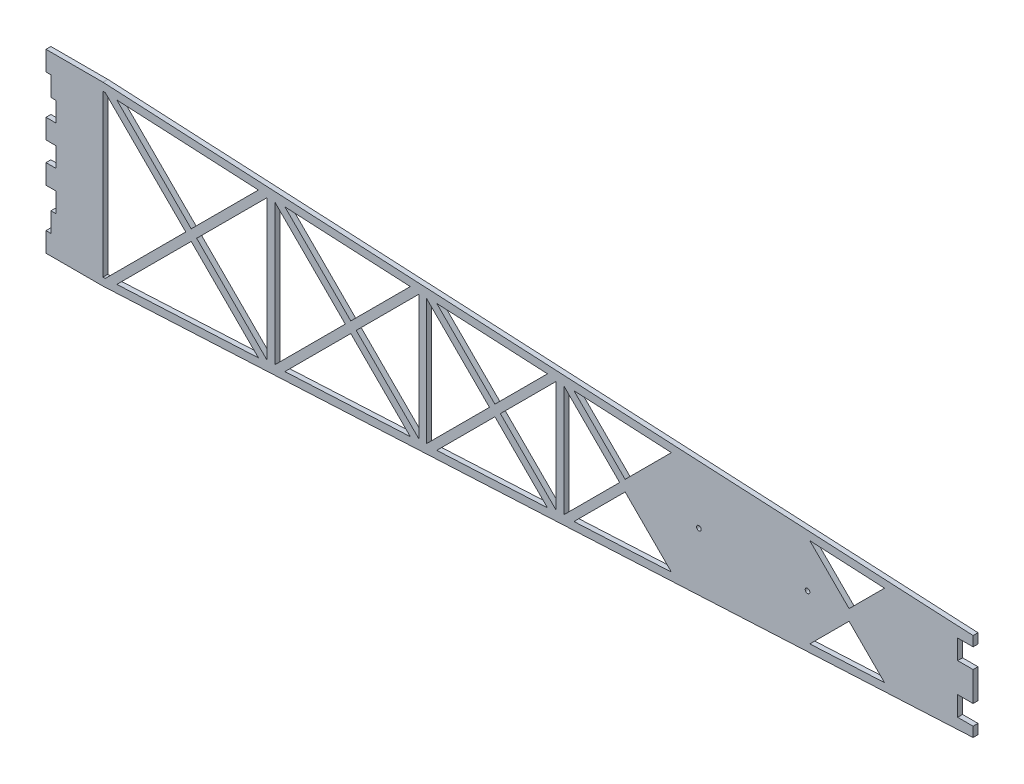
from build123d import *

# Parameters (mm, degrees)
BOSS_EXTRUDE1_DEPTH     = 3.175
CUT_EXTRUDE1_DEPTH      = 611.79830601
CUT_EXTRUDE1_DEPTH_BACK = 611.79830601
CUT_EXTRUDE2_DEPTH      = 611.79830601
CUT_EXTRUDE2_DEPTH_BACK = 611.79830601
SKETCH5_W               = 10
SKETCH5_H               = 12.7
CUT_EXTRUDE3_DEPTH      = 611.79830601
CUT_EXTRUDE3_DEPTH_BACK = 611.79830601
SKETCH6_R               = 1.5
CUT_EXTRUDE4_DEPTH      = 611.79830601
CUT_EXTRUDE4_DEPTH_BACK = 611.79830601


with BuildPart() as part:
    # Sketch1 → Boss-Extrude1 (new body)
    with BuildSketch(Plane.XY):
        Polygon((0, 12.7), (0, 0), (36.83, 0), (600, 28.575), (600, 85.725), (36.83, 114.3), (0, 114.3), (0, 101.6), (3.175, 101.6), (3.175, 88.9), (4.765049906, 88.9), (4.765049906, 76.2), (0, 76.2), (0, 63.5), (6.590050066, 63.5), (6.590050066, 50.8), (0, 50.8), (0, 38.1), (4.765049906, 38.1), (4.765049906, 25.4), (3.175, 25.4), (3.175, 12.7), align=None)
    extrude(amount=-BOSS_EXTRUDE1_DEPTH)

    # Sketch4 → Cut-Extrude1 (cut, two sides: drawn at the far end of the back side and taken through both)
    with BuildSketch(Plane.XY.offset(-CUT_EXTRUDE1_DEPTH_BACK)):
        Polygon((36.83, 5.006432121), (38.379520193, 5.085054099), (90.444466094, 57.15), (38.379520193, 109.214945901), (36.83, 109.293567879), align=None)
        Polygon((93.98, 60.685533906), (137.481043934, 104.18657784), (45.828548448, 108.836985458), align=None)
        Polygon((45.828548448, 5.463014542), (137.481043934, 10.11342216), (93.98, 53.614466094), align=None)
        Polygon((97.515533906, 57.15), (143.110523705, 11.555010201), (143.110523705, 102.744989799), align=None)
        Polygon((148.110523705, 11.555010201), (193.705513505, 57.15), (148.110523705, 102.744989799), align=None)
        Polygon((154.609072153, 10.982490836), (235.755679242, 15.099834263), (197.241047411, 53.614466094), align=None)
        Polygon((154.609072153, 103.317509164), (197.241047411, 60.685533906), (235.755679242, 99.200165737), align=None)
        Polygon((200.776581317, 57.15), (241.385159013, 16.541422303), (241.385159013, 97.758577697), align=None)
        Polygon((246.385159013, 16.541422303), (286.99373671, 57.15), (246.385159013, 97.758577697), align=None)
        Polygon((290.529270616, 60.685533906), (324.539071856, 94.695335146), (252.883707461, 98.331097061), align=None)
        Polygon((252.883707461, 15.968902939), (324.539071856, 19.604664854), (290.529270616, 53.614466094), align=None)
        Polygon((330.168551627, 93.253747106), (294.064804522, 57.15), (330.168551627, 21.046252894), align=None)
        Polygon((335.168551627, 93.253747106), (335.168551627, 21.046252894), (371.272298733, 57.15), align=None)
        Polygon((341.667100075, 93.82626647), (374.807832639, 60.685533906), (404.747874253, 90.62557552), align=None)
        Polygon((374.807832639, 53.614466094), (341.667100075, 20.47373353), (404.747874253, 23.67442448), align=None)
        Polygon((542.67422253, 83.627252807), (494.338237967, 86.079799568), (519.732503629, 60.685533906), align=None)
        Polygon((519.732503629, 53.614466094), (494.338237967, 28.220200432), (542.67422253, 30.672747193), align=None)
    extrude(amount=CUT_EXTRUDE1_DEPTH + CUT_EXTRUDE1_DEPTH_BACK, mode=Mode.SUBTRACT)

    # Sketch5 → Cut-Extrude2 (cut, two sides: drawn at the far end of the back side and taken through both)
    with BuildSketch(Plane.XY.offset(-CUT_EXTRUDE2_DEPTH_BACK)):
        with Locations((595, 73.025)):
            Rectangle(SKETCH5_W, SKETCH5_H)
        with Locations((595, 41.275)):
            Rectangle(SKETCH5_W, SKETCH5_H)
    extrude(amount=CUT_EXTRUDE2_DEPTH + CUT_EXTRUDE2_DEPTH_BACK, mode=Mode.SUBTRACT)

    # Sketch6 → Cut-Extrude3 (cut, two sides: drawn at the far end of the back side and taken through both)
    with BuildSketch(Plane.XY.offset(-CUT_EXTRUDE3_DEPTH_BACK)):
        with Locations((422.53, 57.15)):
            Circle(SKETCH6_R)
        with Locations((492.8318717, 57.15)):
            Circle(SKETCH6_R)
    extrude(amount=CUT_EXTRUDE3_DEPTH + CUT_EXTRUDE3_DEPTH_BACK, mode=Mode.SUBTRACT)

    # Sketch7 → Cut-Extrude4 (cut, two sides: drawn at the far end of the back side and taken through both)
    with BuildSketch(Plane.XY.offset(-CUT_EXTRUDE4_DEPTH_BACK)):
        Polygon((3.175, 88.9), (6.590050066, 88.9), (6.590050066, 76.2), (0, 76.2), align=None)
        Polygon((0, 38.1), (6.590050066, 38.1), (6.590050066, 25.4), (3.175, 25.4), (-1.071097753, 25.4), align=None)
    extrude(amount=CUT_EXTRUDE4_DEPTH + CUT_EXTRUDE4_DEPTH_BACK, mode=Mode.SUBTRACT)


solid = part.part
